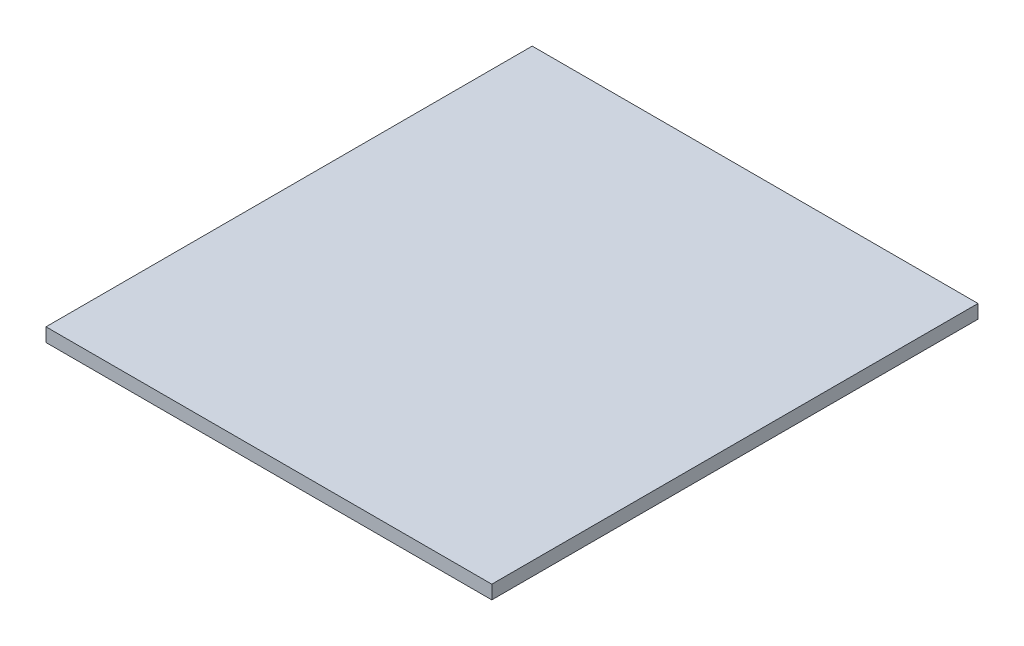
from build123d import *

# Parameters (mm, degrees)
SKIZZE1_W                       = 3.268487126
SKIZZE1_H                       = 3.564829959
AUFSATZ_LINEAR_AUSTRAGEN1_DEPTH = 0.1


with BuildPart() as part:
    # Skizze1 → Aufsatz-Linear austragen1 (new body)
    with BuildSketch(Plane(origin=(0, 0, 0), x_dir=(1, 0, 0), z_dir=(0, 1, 0))):
        with Locations((-0.004357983, -0.013073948)):
            Rectangle(SKIZZE1_W, SKIZZE1_H)
    extrude(amount=AUFSATZ_LINEAR_AUSTRAGEN1_DEPTH)


solid = part.part
